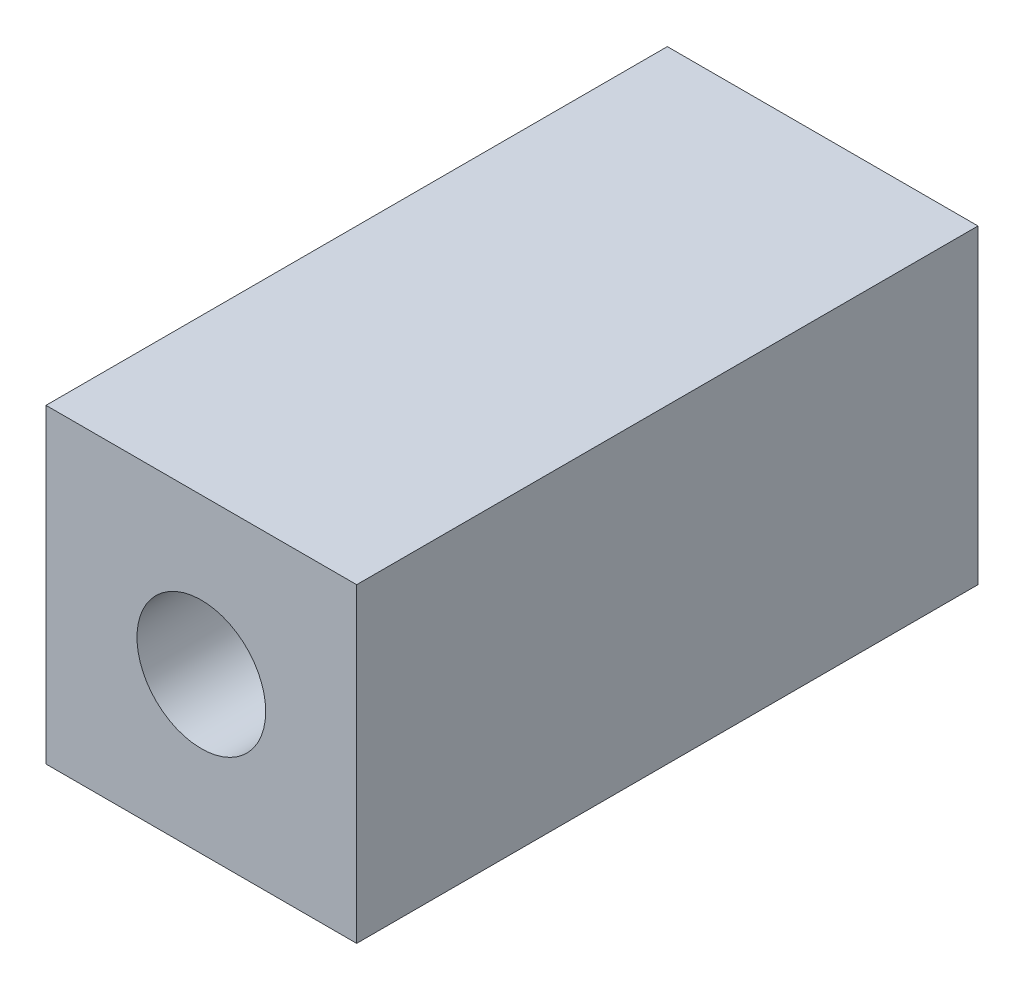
from build123d import *

# Parameters (mm, degrees)
ESQUISSE1_W                = 35
ESQUISSE1_H                = 35
EXTRUSION1_DEPTH           = 70
TROU_TARAUD_M16X1_51_D     = 14.5
TROU_TARAUD_M16X1_51_DEPTH = 51.5
TROU_TARAUD_M16X1_51_TIP   = 4.356239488


with BuildPart() as part:
    # Esquisse1 → Extrusion1 (new body)
    with BuildSketch(Plane.XY):
        with Locations((17.5, 17.5)):
            Rectangle(ESQUISSE1_W, ESQUISSE1_H)
    extrude(amount=EXTRUSION1_DEPTH)

    # Trou taraud_ M16x1.51
    with Locations(Plane.XY.offset(70)):
        with Locations((17.5, 17.5)):
            Hole(TROU_TARAUD_M16X1_51_D / 2, depth=TROU_TARAUD_M16X1_51_DEPTH)
            with Locations((0, 0, -(TROU_TARAUD_M16X1_51_DEPTH + TROU_TARAUD_M16X1_51_TIP / 2))):  # 118° drill point
                Cone(0, TROU_TARAUD_M16X1_51_D / 2, TROU_TARAUD_M16X1_51_TIP, mode=Mode.SUBTRACT)


solid = part.part
